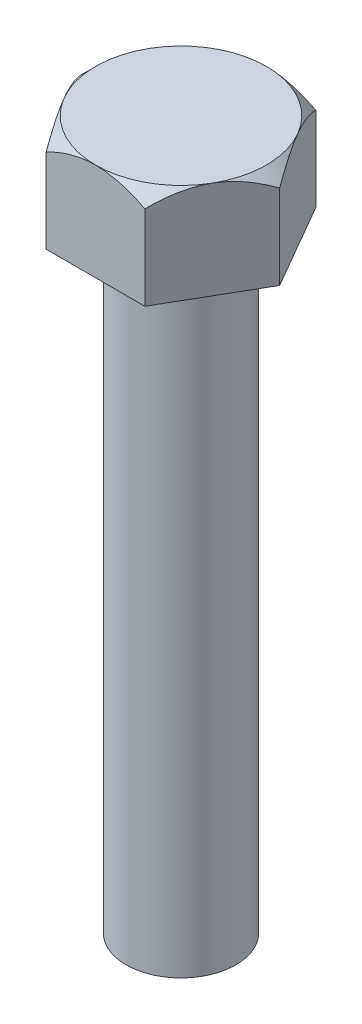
ISO-10303-21;
HEADER;
FILE_DESCRIPTION(('STEP AP214'),'2;1');
FILE_NAME('part.step','',(''),(''),'','','');
FILE_SCHEMA(('AUTOMOTIVE_DESIGN { 1 0 10303 214 1 1 1 1 }'));
ENDSEC;
DATA;
#1=APPLICATION_CONTEXT('core data for automotive mechanical design processes');
#2=APPLICATION_PROTOCOL_DEFINITION('international standard','automotive_design',2000,#1);
#3=PRODUCT_CONTEXT('',#1,'mechanical');
#4=PRODUCT('Part','Part','',(#3));
#5=PRODUCT_RELATED_PRODUCT_CATEGORY('part','',(#4));
#6=PRODUCT_DEFINITION_FORMATION('','',#4);
#7=PRODUCT_DEFINITION_CONTEXT('part definition',#1,'design');
#8=PRODUCT_DEFINITION('design','',#6,#7);
#9=PRODUCT_DEFINITION_SHAPE('','',#8);
#10=(LENGTH_UNIT() NAMED_UNIT(*) SI_UNIT(.MILLI.,.METRE.));
#11=(NAMED_UNIT(*) PLANE_ANGLE_UNIT() SI_UNIT($,.RADIAN.));
#12=(NAMED_UNIT(*) SI_UNIT($,.STERADIAN.) SOLID_ANGLE_UNIT());
#13=UNCERTAINTY_MEASURE_WITH_UNIT(LENGTH_MEASURE(1.E-05),#10,'distance_accuracy_value','');
#14=(GEOMETRIC_REPRESENTATION_CONTEXT(3) GLOBAL_UNCERTAINTY_ASSIGNED_CONTEXT((#13)) GLOBAL_UNIT_ASSIGNED_CONTEXT((#10,
#11,#12)) REPRESENTATION_CONTEXT('',''));
#15=CARTESIAN_POINT('',(0.,0.,0.));
#16=DIRECTION('',(0.,0.,1.));
#17=DIRECTION('',(1.,0.,0.));
#18=AXIS2_PLACEMENT_3D('',#15,#16,#17);
#19=CARTESIAN_POINT('',(2.02072594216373,4.,3.49999999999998));
#20=DIRECTION('',(-0.866025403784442,0.,-0.499999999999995));
#21=DIRECTION('',(-0.499999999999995,0.,0.866025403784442));
#22=AXIS2_PLACEMENT_3D('',#19,#20,#21);
#23=PLANE('',#22);
#24=CARTESIAN_POINT('',(2.02061047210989,3.45843264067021,3.50019999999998));
#25=CARTESIAN_POINT('',(2.09007076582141,3.52783218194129,3.37989124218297));
#26=CARTESIAN_POINT('',(2.16069251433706,3.59315563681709,3.25757078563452));
#27=CARTESIAN_POINT('',(2.30469791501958,3.71276106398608,3.00814611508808));
#28=CARTESIAN_POINT('',(2.37809526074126,3.76697649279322,2.88101818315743));
#29=CARTESIAN_POINT('',(2.52609746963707,3.85984844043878,2.62467083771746));
#30=CARTESIAN_POINT('',(2.60066464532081,3.89873837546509,2.4955167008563));
#31=CARTESIAN_POINT('',(2.75144053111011,3.95865621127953,2.23436520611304));
#32=CARTESIAN_POINT('',(2.8276446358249,3.97972883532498,2.10237582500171));
#33=CARTESIAN_POINT('',(2.95898000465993,3.99874200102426,1.87489629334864));
#34=CARTESIAN_POINT('',(3.01394167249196,4.00155641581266,1.77969989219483));
#35=CARTESIAN_POINT('',(3.12377560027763,3.99681342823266,1.5894619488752));
#36=CARTESIAN_POINT('',(3.17864782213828,3.98925238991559,1.49442047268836));
#37=CARTESIAN_POINT('',(3.28787240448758,3.9641902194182,1.30523794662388));
#38=CARTESIAN_POINT('',(3.34222411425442,3.9466779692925,1.21109802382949));
#39=CARTESIAN_POINT('',(3.44999406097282,3.90266921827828,1.02443500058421));
#40=CARTESIAN_POINT('',(3.50341236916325,3.87617340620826,0.931911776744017));
#41=CARTESIAN_POINT('',(3.59824414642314,3.82166014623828,0.767658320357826));
#42=CARTESIAN_POINT('',(3.63986754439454,3.79507581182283,0.695564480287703));
#43=CARTESIAN_POINT('',(3.72236709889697,3.73762274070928,0.552671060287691));
#44=CARTESIAN_POINT('',(3.76324323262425,3.70675387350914,0.48187151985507));
#45=CARTESIAN_POINT('',(3.84411947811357,3.64142377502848,0.341789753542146));
#46=CARTESIAN_POINT('',(3.88412189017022,3.60697384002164,0.272503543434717));
#47=CARTESIAN_POINT('',(3.96338588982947,3.53493401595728,0.135214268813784));
#48=CARTESIAN_POINT('',(4.00264791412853,3.49734605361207,0.0672104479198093));
#49=CARTESIAN_POINT('',(4.04156735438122,3.45843264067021,-0.000200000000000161));
#50=B_SPLINE_CURVE_WITH_KNOTS('',3,(#24,#25,#26,#27,#28,#29,#30,#31,#32,#33,#34,#35,#36,#37,#38,
#39,#40,#41,#42,#43,#44,#45,#46,#47,#48,#49),.UNSPECIFIED.,.F.,.F.,(4,2,2,2,2,2,2,2,2,2,2,2,4),
(0.,0.466195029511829,0.935106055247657,1.39657035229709,1.85687285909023,2.18628459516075,
2.5158117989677,2.84570789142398,3.17557869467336,3.43762138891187,3.69967206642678,
3.96091985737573,4.22200840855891),.UNSPECIFIED.);
#51=CARTESIAN_POINT('',(2.02072594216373,3.45854811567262,3.49999999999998));
#52=VERTEX_POINT('',#51);
#53=CARTESIAN_POINT('',(3.03108891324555,4.,1.74999999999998));
#54=VERTEX_POINT('',#53);
#55=EDGE_CURVE('E115',#52,#54,#50,.T.);
#56=ORIENTED_EDGE('',*,*,#55,.F.);
#57=DIRECTION('',(0.,-1.,0.));
#58=VECTOR('',#57,1.);
#59=CARTESIAN_POINT('',(2.02072594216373,4.,3.49999999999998));
#60=LINE('',#59,#58);
#61=CARTESIAN_POINT('',(2.02072594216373,0.,3.49999999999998));
#62=VERTEX_POINT('',#61);
#63=EDGE_CURVE('E64',#52,#62,#60,.T.);
#64=ORIENTED_EDGE('',*,*,#63,.T.);
#65=DIRECTION('',(0.499999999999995,0.,-0.866025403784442));
#66=VECTOR('',#65,1.);
#67=CARTESIAN_POINT('',(2.02072594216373,0.,3.49999999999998));
#68=LINE('',#67,#66);
#69=CARTESIAN_POINT('',(4.04145188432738,0.,0.));
#70=VERTEX_POINT('',#69);
#71=EDGE_CURVE('E253',#62,#70,#68,.T.);
#72=ORIENTED_EDGE('',*,*,#71,.T.);
#73=DIRECTION('',(0.,-1.,0.));
#74=VECTOR('',#73,1.);
#75=CARTESIAN_POINT('',(4.04145188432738,4.,0.));
#76=LINE('',#75,#74);
#77=CARTESIAN_POINT('',(4.04145188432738,3.45854811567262,0.));
#78=VERTEX_POINT('',#77);
#79=EDGE_CURVE('E137',#78,#70,#76,.T.);
#80=ORIENTED_EDGE('',*,*,#79,.F.);
#81=EDGE_CURVE('E124',#54,#78,#50,.T.);
#82=ORIENTED_EDGE('',*,*,#81,.F.);
#83=EDGE_LOOP('',(#56,#64,#72,#80,#82));
#84=FACE_BOUND('',#83,.T.);
#85=ADVANCED_FACE('F40',(#84),#23,.F.);
#86=CARTESIAN_POINT('',(4.04145188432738,4.,0.));
#87=DIRECTION('',(-0.866025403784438,0.,0.500000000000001));
#88=DIRECTION('',(0.500000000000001,0.,0.866025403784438));
#89=AXIS2_PLACEMENT_3D('',#86,#87,#88);
#90=PLANE('',#89);
#91=CARTESIAN_POINT('',(4.04156735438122,3.45843264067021,0.0002));
#92=CARTESIAN_POINT('',(3.9721070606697,3.52783218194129,-0.120108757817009));
#93=CARTESIAN_POINT('',(3.90148531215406,3.59315563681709,-0.242429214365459));
#94=CARTESIAN_POINT('',(3.75747991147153,3.71276106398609,-0.491853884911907));
#95=CARTESIAN_POINT('',(3.68408256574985,3.76697649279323,-0.618981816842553));
#96=CARTESIAN_POINT('',(3.53608035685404,3.85984844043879,-0.875329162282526));
#97=CARTESIAN_POINT('',(3.46151318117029,3.8987383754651,-1.00448329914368));
#98=CARTESIAN_POINT('',(3.31073729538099,3.95865621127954,-1.26563479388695));
#99=CARTESIAN_POINT('',(3.2345331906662,3.979728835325,-1.39762417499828));
#100=CARTESIAN_POINT('',(3.10319782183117,3.99874200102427,-1.62510370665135));
#101=CARTESIAN_POINT('',(3.04823615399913,4.00155641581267,-1.72030010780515));
#102=CARTESIAN_POINT('',(2.93840222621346,3.99681342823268,-1.91053805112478));
#103=CARTESIAN_POINT('',(2.88353000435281,3.98925238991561,-2.00557952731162));
#104=CARTESIAN_POINT('',(2.77430542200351,3.96419021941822,-2.1947620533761));
#105=CARTESIAN_POINT('',(2.71995371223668,3.94667796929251,-2.2889019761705));
#106=CARTESIAN_POINT('',(2.61218376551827,3.9026692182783,-2.47556499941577));
#107=CARTESIAN_POINT('',(2.55876545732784,3.87617340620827,-2.56808822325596));
#108=CARTESIAN_POINT('',(2.46393368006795,3.82166014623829,-2.73234167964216));
#109=CARTESIAN_POINT('',(2.42231028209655,3.79507581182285,-2.80443551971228));
#110=CARTESIAN_POINT('',(2.33981072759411,3.73762274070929,-2.9473289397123));
#111=CARTESIAN_POINT('',(2.29893459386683,3.70675387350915,-3.01812848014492));
#112=CARTESIAN_POINT('',(2.21805834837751,3.64142377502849,-3.15821024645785));
#113=CARTESIAN_POINT('',(2.17805593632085,3.60697384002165,-3.22749645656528));
#114=CARTESIAN_POINT('',(2.0987919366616,3.53493401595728,-3.36478573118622));
#115=CARTESIAN_POINT('',(2.05952991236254,3.49734605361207,-3.4327895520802));
#116=CARTESIAN_POINT('',(2.02061047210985,3.45843264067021,-3.50020000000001));
#117=B_SPLINE_CURVE_WITH_KNOTS('',3,(#91,#92,#93,#94,#95,#96,#97,#98,#99,#100,#101,#102,#103,
#104,#105,#106,#107,#108,#109,#110,#111,#112,#113,#114,#115,#116),.UNSPECIFIED.,.F.,.F.,(4,2,2,
2,2,2,2,2,2,2,2,2,4),(0.,0.466195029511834,0.935106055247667,1.3965703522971,1.85687285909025,
2.18628459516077,2.51581179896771,2.845707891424,3.17557869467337,3.43762138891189,
3.69967206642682,3.96091985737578,4.22200840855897),.UNSPECIFIED.);
#118=CARTESIAN_POINT('',(3.03108891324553,4.,-1.75));
#119=VERTEX_POINT('',#118);
#120=EDGE_CURVE('E129',#78,#119,#117,.T.);
#121=ORIENTED_EDGE('',*,*,#120,.F.);
#122=ORIENTED_EDGE('',*,*,#79,.T.);
#123=DIRECTION('',(-0.500000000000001,0.,-0.866025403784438));
#124=VECTOR('',#123,1.);
#125=CARTESIAN_POINT('',(4.04145188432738,0.,0.));
#126=LINE('',#125,#124);
#127=CARTESIAN_POINT('',(2.02072594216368,0.,-3.50000000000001));
#128=VERTEX_POINT('',#127);
#129=EDGE_CURVE('E256',#70,#128,#126,.T.);
#130=ORIENTED_EDGE('',*,*,#129,.T.);
#131=DIRECTION('',(0.,-1.,0.));
#132=VECTOR('',#131,1.);
#133=CARTESIAN_POINT('',(2.02072594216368,4.,-3.50000000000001));
#134=LINE('',#133,#132);
#135=CARTESIAN_POINT('',(2.02072594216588,3.45854811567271,-3.50000000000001));
#136=VERTEX_POINT('',#135);
#137=EDGE_CURVE('E210',#136,#128,#134,.T.);
#138=ORIENTED_EDGE('',*,*,#137,.F.);
#139=EDGE_CURVE('E140',#119,#136,#117,.T.);
#140=ORIENTED_EDGE('',*,*,#139,.F.);
#141=EDGE_LOOP('',(#121,#122,#130,#138,#140));
#142=FACE_BOUND('',#141,.T.);
#143=ADVANCED_FACE('F198',(#142),#90,.F.);
#144=CARTESIAN_POINT('',(2.02072594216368,4.,-3.50000000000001));
#145=DIRECTION('',(0.,0.,1.));
#146=DIRECTION('',(1.,0.,0.));
#147=AXIS2_PLACEMENT_3D('',#144,#145,#146);
#148=PLANE('',#147);
#149=CARTESIAN_POINT('',(7.70716664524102,-0.96465697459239,-3.50000000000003));
#150=CARTESIAN_POINT('',(7.48137878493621,-0.759135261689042,-3.50000000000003));
#151=CARTESIAN_POINT('',(7.25487498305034,-0.554389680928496,-3.50000000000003));
#152=CARTESIAN_POINT('',(6.79984084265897,-0.147044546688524,-3.50000000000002));
#153=CARTESIAN_POINT('',(6.57130998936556,0.0555544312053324,-3.50000000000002));
#154=CARTESIAN_POINT('',(6.10997227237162,0.459456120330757,-3.50000000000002));
#155=CARTESIAN_POINT('',(5.87714602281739,0.660736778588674,-3.50000000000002));
#156=CARTESIAN_POINT('',(5.52538737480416,0.95965543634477,-3.50000000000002));
#157=CARTESIAN_POINT('',(5.40772405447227,1.05878684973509,-3.50000000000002));
#158=CARTESIAN_POINT('',(5.17140128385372,1.25587149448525,-3.50000000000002));
#159=CARTESIAN_POINT('',(5.05274176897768,1.35382464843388,-3.50000000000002));
#160=CARTESIAN_POINT('',(4.72855665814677,1.61823727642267,-3.50000000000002));
#161=CARTESIAN_POINT('',(4.52190647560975,1.78332365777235,-3.50000000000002));
#162=CARTESIAN_POINT('',(4.10413126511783,2.10773727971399,-3.50000000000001));
#163=CARTESIAN_POINT('',(3.89300676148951,2.26706518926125,-3.50000000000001));
#164=CARTESIAN_POINT('',(3.57190983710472,2.49968433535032,-3.50000000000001));
#165=CARTESIAN_POINT('',(3.46421302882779,2.5761149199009,-3.50000000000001));
#166=CARTESIAN_POINT('',(3.24704746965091,2.72641028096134,-3.50000000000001));
#167=CARTESIAN_POINT('',(3.13757882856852,2.8002752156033,-3.50000000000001));
#168=CARTESIAN_POINT('',(2.91663090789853,2.94480957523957,-3.50000000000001));
#169=CARTESIAN_POINT('',(2.805152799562,3.01548078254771,-3.50000000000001));
#170=CARTESIAN_POINT('',(2.57979608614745,3.15289000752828,-3.50000000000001));
#171=CARTESIAN_POINT('',(2.46591757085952,3.21962817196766,-3.50000000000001));
#172=CARTESIAN_POINT('',(2.23926046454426,3.34599637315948,-3.50000000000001));
#173=CARTESIAN_POINT('',(2.12657447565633,3.40579029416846,-3.50000000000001));
#174=CARTESIAN_POINT('',(1.89832432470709,3.51956975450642,-3.50000000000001));
#175=CARTESIAN_POINT('',(1.78275963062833,3.57355421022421,-3.50000000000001));
#176=CARTESIAN_POINT('',(1.43160000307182,3.72442650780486,-3.50000000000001));
#177=CARTESIAN_POINT('',(1.19096103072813,3.81057245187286,-3.5));
#178=CARTESIAN_POINT('',(0.844192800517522,3.90093897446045,-3.5));
#179=CARTESIAN_POINT('',(0.742755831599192,3.92347008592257,-3.5));
#180=CARTESIAN_POINT('',(0.538372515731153,3.96026053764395,-3.5));
#181=CARTESIAN_POINT('',(0.435426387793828,3.97452106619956,-3.5));
#182=CARTESIAN_POINT('',(0.228874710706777,3.99402845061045,-3.5));
#183=CARTESIAN_POINT('',(0.125270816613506,3.99929264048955,-3.5));
#184=CARTESIAN_POINT('',(-0.0819976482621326,4.00057360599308,-3.5));
#185=CARTESIAN_POINT('',(-0.185662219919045,3.9965902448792,-3.5));
#186=CARTESIAN_POINT('',(-0.391954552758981,3.9796186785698,-3.5));
#187=CARTESIAN_POINT('',(-0.494584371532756,3.96665508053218,-3.5));
#188=CARTESIAN_POINT('',(-0.698450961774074,3.93240601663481,-3.5));
#189=CARTESIAN_POINT('',(-0.799687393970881,3.91111855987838,-3.5));
#190=CARTESIAN_POINT('',(-1.00055886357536,3.86109571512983,-3.5));
#191=CARTESIAN_POINT('',(-1.10018908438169,3.83234121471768,-3.5));
#192=CARTESIAN_POINT('',(-1.29735290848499,3.76845561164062,-3.5));
#193=CARTESIAN_POINT('',(-1.39488662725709,3.73332486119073,-3.5));
#194=CARTESIAN_POINT('',(-1.62398143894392,3.64352283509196,-3.5));
#195=CARTESIAN_POINT('',(-1.75460225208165,3.58646149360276,-3.49999999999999));
#196=CARTESIAN_POINT('',(-2.01212538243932,3.46443559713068,-3.49999999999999));
#197=CARTESIAN_POINT('',(-2.13902566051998,3.39946680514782,-3.49999999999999));
#198=CARTESIAN_POINT('',(-2.38975030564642,3.26327874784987,-3.49999999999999));
#199=CARTESIAN_POINT('',(-2.51356756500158,3.19204649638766,-3.49999999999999));
#200=CARTESIAN_POINT('',(-2.75828903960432,3.04482209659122,-3.49999999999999));
#201=CARTESIAN_POINT('',(-2.87919376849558,2.96883079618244,-3.49999999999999));
#202=CARTESIAN_POINT('',(-3.11981544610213,2.81226955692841,-3.49999999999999));
#203=CARTESIAN_POINT('',(-3.23950628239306,2.73165967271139,-3.49999999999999));
#204=CARTESIAN_POINT('',(-3.47678034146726,2.56738645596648,-3.49999999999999));
#205=CARTESIAN_POINT('',(-3.59436338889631,2.48372287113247,-3.49999999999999));
#206=CARTESIAN_POINT('',(-3.8275953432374,2.31404838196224,-3.49999999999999));
#207=CARTESIAN_POINT('',(-3.94324646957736,2.22804051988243,-3.49999999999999));
#208=CARTESIAN_POINT('',(-4.17303756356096,2.05402747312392,-3.49999999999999));
#209=CARTESIAN_POINT('',(-4.28717748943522,1.96602223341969,-3.49999999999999));
#210=CARTESIAN_POINT('',(-4.5459744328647,1.7634775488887,-3.49999999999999));
#211=CARTESIAN_POINT('',(-4.69022023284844,1.64841320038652,-3.49999999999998));
#212=CARTESIAN_POINT('',(-4.97697874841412,1.41614645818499,-3.49999999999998));
#213=CARTESIAN_POINT('',(-5.11949143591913,1.29894402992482,-3.49999999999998));
#214=CARTESIAN_POINT('',(-5.54501613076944,0.94466948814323,-3.49999999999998));
#215=CARTESIAN_POINT('',(-5.82588928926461,0.705029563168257,-3.49999999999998));
#216=CARTESIAN_POINT('',(-6.37505783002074,0.228589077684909,-3.49999999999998));
#217=CARTESIAN_POINT('',(-6.64347451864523,-0.00807251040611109,-3.49999999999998));
#218=CARTESIAN_POINT('',(-7.04391472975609,-0.365311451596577,-3.49999999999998));
#219=CARTESIAN_POINT('',(-7.17698223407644,-0.484721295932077,-3.49999999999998));
#220=CARTESIAN_POINT('',(-7.44250845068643,-0.724211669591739,-3.49999999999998));
#221=CARTESIAN_POINT('',(-7.57496717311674,-0.844292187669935,-3.49999999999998));
#222=CARTESIAN_POINT('',(-7.70716664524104,-0.964656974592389,-3.49999999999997));
#223=B_SPLINE_CURVE_WITH_KNOTS('',3,(#149,#150,#151,#152,#153,#154,#155,#156,#157,#158,#159,
#160,#161,#162,#163,#164,#165,#166,#167,#168,#169,#170,#171,#172,#173,#174,#175,#176,#177,#178,
#179,#180,#181,#182,#183,#184,#185,#186,#187,#188,#189,#190,#191,#192,#193,#194,#195,#196,#197,
#198,#199,#200,#201,#202,#203,#204,#205,#206,#207,#208,#209,#210,#211,#212,#213,#214,#215,#216,
#217,#218,#219,#220,#221,#222),.UNSPECIFIED.,.F.,.F.,(4,2,2,2,2,2,2,2,2,2,2,2,2,2,2,2,2,2,2,2,2,
2,2,2,2,2,2,2,2,2,2,2,2,2,2,2,4),(0.,0.915963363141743,1.8321664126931,2.75543658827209,
3.21699839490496,3.67859036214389,4.47201065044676,5.26533846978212,5.66149422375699,
6.05762551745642,6.45353294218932,6.84942558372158,7.23195625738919,7.61455815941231,
8.37775884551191,8.68921200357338,9.00062040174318,9.31142810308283,9.62224040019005,
9.93220437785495,10.2422425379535,10.5530822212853,10.8639047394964,11.2911653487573,
11.7186559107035,12.1470546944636,12.5753773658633,13.0082330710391,13.4411246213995,
13.8734788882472,14.3058450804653,14.8593699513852,15.412903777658,16.5204516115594,
17.5939713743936,18.1303377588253,18.6666951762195),.UNSPECIFIED.);
#224=CARTESIAN_POINT('',(0.,4.,-3.5));
#225=VERTEX_POINT('',#224);
#226=EDGE_CURVE('E192',#136,#225,#223,.T.);
#227=ORIENTED_EDGE('',*,*,#226,.F.);
#228=ORIENTED_EDGE('',*,*,#137,.T.);
#229=DIRECTION('',(-1.,0.,0.));
#230=VECTOR('',#229,1.);
#231=CARTESIAN_POINT('',(2.02072594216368,0.,-3.50000000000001));
#232=LINE('',#231,#230);
#233=CARTESIAN_POINT('',(-2.02072594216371,0.,-3.49999999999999));
#234=VERTEX_POINT('',#233);
#235=EDGE_CURVE('E232',#128,#234,#232,.T.);
#236=ORIENTED_EDGE('',*,*,#235,.T.);
#237=DIRECTION('',(0.,-1.,0.));
#238=VECTOR('',#237,1.);
#239=CARTESIAN_POINT('',(-2.02072594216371,4.,-3.49999999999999));
#240=LINE('',#239,#238);
#241=CARTESIAN_POINT('',(-2.02072594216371,3.45854811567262,-3.49999999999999));
#242=VERTEX_POINT('',#241);
#243=EDGE_CURVE('E230',#242,#234,#240,.T.);
#244=ORIENTED_EDGE('',*,*,#243,.F.);
#245=EDGE_CURVE('E185',#225,#242,#223,.T.);
#246=ORIENTED_EDGE('',*,*,#245,.F.);
#247=EDGE_LOOP('',(#227,#228,#236,#244,#246));
#248=FACE_BOUND('',#247,.T.);
#249=ADVANCED_FACE('F194',(#248),#148,.F.);
#250=CARTESIAN_POINT('',(-2.02072594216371,4.,-3.49999999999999));
#251=DIRECTION('',(0.866025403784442,0.,0.499999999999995));
#252=DIRECTION('',(0.499999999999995,0.,-0.866025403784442));
#253=AXIS2_PLACEMENT_3D('',#250,#251,#252);
#254=PLANE('',#253);
#255=CARTESIAN_POINT('',(-2.02061047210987,3.45843264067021,-3.50019999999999));
#256=CARTESIAN_POINT('',(-2.09007076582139,3.52783218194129,-3.37989124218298));
#257=CARTESIAN_POINT('',(-2.16069251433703,3.59315563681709,-3.25757078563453));
#258=CARTESIAN_POINT('',(-2.30469791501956,3.71276106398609,-3.00814611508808));
#259=CARTESIAN_POINT('',(-2.37809526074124,3.76697649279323,-2.88101818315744));
#260=CARTESIAN_POINT('',(-2.52609746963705,3.85984844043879,-2.62467083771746));
#261=CARTESIAN_POINT('',(-2.60066464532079,3.8987383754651,-2.4955167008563));
#262=CARTESIAN_POINT('',(-2.75144053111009,3.95865621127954,-2.23436520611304));
#263=CARTESIAN_POINT('',(-2.82764463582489,3.979728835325,-2.10237582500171));
#264=CARTESIAN_POINT('',(-2.95898000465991,3.99874200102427,-1.87489629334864));
#265=CARTESIAN_POINT('',(-3.01394167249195,4.00155641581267,-1.77969989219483));
#266=CARTESIAN_POINT('',(-3.12377560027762,3.99681342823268,-1.5894619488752));
#267=CARTESIAN_POINT('',(-3.17864782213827,3.98925238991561,-1.49442047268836));
#268=CARTESIAN_POINT('',(-3.28787240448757,3.96419021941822,-1.30523794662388));
#269=CARTESIAN_POINT('',(-3.3422241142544,3.94667796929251,-1.21109802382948));
#270=CARTESIAN_POINT('',(-3.44999406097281,3.9026692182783,-1.02443500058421));
#271=CARTESIAN_POINT('',(-3.50341236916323,3.87617340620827,-0.931911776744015));
#272=CARTESIAN_POINT('',(-3.59824414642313,3.82166014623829,-0.767658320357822));
#273=CARTESIAN_POINT('',(-3.63986754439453,3.79507581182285,-0.695564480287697));
#274=CARTESIAN_POINT('',(-3.72236709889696,3.73762274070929,-0.55267106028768));
#275=CARTESIAN_POINT('',(-3.76324323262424,3.70675387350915,-0.481871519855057));
#276=CARTESIAN_POINT('',(-3.84411947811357,3.64142377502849,-0.341789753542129));
#277=CARTESIAN_POINT('',(-3.88412189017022,3.60697384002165,-0.272503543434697));
#278=CARTESIAN_POINT('',(-3.96338588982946,3.53493401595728,-0.13521426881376));
#279=CARTESIAN_POINT('',(-4.00264791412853,3.49734605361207,-0.0672104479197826));
#280=CARTESIAN_POINT('',(-4.04156735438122,3.45843264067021,0.000200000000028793));
#281=B_SPLINE_CURVE_WITH_KNOTS('',3,(#255,#256,#257,#258,#259,#260,#261,#262,#263,#264,#265,
#266,#267,#268,#269,#270,#271,#272,#273,#274,#275,#276,#277,#278,#279,#280),.UNSPECIFIED.,.F.,
.F.,(4,2,2,2,2,2,2,2,2,2,2,2,4),(0.,0.466195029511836,0.93510605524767,1.39657035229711,
1.85687285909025,2.18628459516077,2.51581179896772,2.84570789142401,3.17557869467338,
3.4376213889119,3.69967206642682,3.96091985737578,4.22200840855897),.UNSPECIFIED.);
#282=CARTESIAN_POINT('',(-3.03108891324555,4.,-1.74999999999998));
#283=VERTEX_POINT('',#282);
#284=EDGE_CURVE('E193',#242,#283,#281,.T.);
#285=ORIENTED_EDGE('',*,*,#284,.F.);
#286=ORIENTED_EDGE('',*,*,#243,.T.);
#287=DIRECTION('',(-0.499999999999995,0.,0.866025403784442));
#288=VECTOR('',#287,1.);
#289=CARTESIAN_POINT('',(-2.02072594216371,0.,-3.49999999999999));
#290=LINE('',#289,#288);
#291=CARTESIAN_POINT('',(-4.04145188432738,0.,0.));
#292=VERTEX_POINT('',#291);
#293=EDGE_CURVE('E261',#234,#292,#290,.T.);
#294=ORIENTED_EDGE('',*,*,#293,.T.);
#295=DIRECTION('',(0.,-1.,0.));
#296=VECTOR('',#295,1.);
#297=CARTESIAN_POINT('',(-4.04145188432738,4.,0.));
#298=LINE('',#297,#296);
#299=CARTESIAN_POINT('',(-4.04145188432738,3.45854811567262,0.));
#300=VERTEX_POINT('',#299);
#301=EDGE_CURVE('E237',#300,#292,#298,.T.);
#302=ORIENTED_EDGE('',*,*,#301,.F.);
#303=EDGE_CURVE('E179',#283,#300,#281,.T.);
#304=ORIENTED_EDGE('',*,*,#303,.F.);
#305=EDGE_LOOP('',(#285,#286,#294,#302,#304));
#306=FACE_BOUND('',#305,.T.);
#307=ADVANCED_FACE('F197',(#306),#254,.F.);
#308=CARTESIAN_POINT('',(-4.04145188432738,4.,0.));
#309=DIRECTION('',(0.866025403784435,0.,-0.500000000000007));
#310=DIRECTION('',(-0.500000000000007,0.,-0.866025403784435));
#311=AXIS2_PLACEMENT_3D('',#308,#309,#310);
#312=PLANE('',#311);
#313=CARTESIAN_POINT('',(-4.04156735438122,3.45843264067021,-0.000199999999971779));
#314=CARTESIAN_POINT('',(-3.9721070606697,3.52783218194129,0.120108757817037));
#315=CARTESIAN_POINT('',(-3.90148531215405,3.59315563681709,0.242429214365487));
#316=CARTESIAN_POINT('',(-3.75747991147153,3.71276106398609,0.491853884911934));
#317=CARTESIAN_POINT('',(-3.68408256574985,3.76697649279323,0.618981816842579));
#318=CARTESIAN_POINT('',(-3.53608035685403,3.85984844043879,0.875329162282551));
#319=CARTESIAN_POINT('',(-3.46151318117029,3.8987383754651,1.00448329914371));
#320=CARTESIAN_POINT('',(-3.31073729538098,3.95865621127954,1.26563479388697));
#321=CARTESIAN_POINT('',(-3.23453319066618,3.979728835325,1.3976241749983));
#322=CARTESIAN_POINT('',(-3.10319782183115,3.99874200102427,1.62510370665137));
#323=CARTESIAN_POINT('',(-3.04823615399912,4.00155641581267,1.72030010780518));
#324=CARTESIAN_POINT('',(-2.93840222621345,3.99681342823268,1.9105380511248));
#325=CARTESIAN_POINT('',(-2.8835300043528,3.98925238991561,2.00557952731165));
#326=CARTESIAN_POINT('',(-2.7743054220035,3.96419021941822,2.19476205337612));
#327=CARTESIAN_POINT('',(-2.71995371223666,3.94667796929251,2.28890197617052));
#328=CARTESIAN_POINT('',(-2.61218376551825,3.9026692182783,2.47556499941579));
#329=CARTESIAN_POINT('',(-2.55876545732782,3.87617340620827,2.56808822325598));
#330=CARTESIAN_POINT('',(-2.46393368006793,3.82166014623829,2.73234167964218));
#331=CARTESIAN_POINT('',(-2.42231028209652,3.79507581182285,2.8044355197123));
#332=CARTESIAN_POINT('',(-2.33981072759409,3.73762274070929,2.94732893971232));
#333=CARTESIAN_POINT('',(-2.29893459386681,3.70675387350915,3.01812848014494));
#334=CARTESIAN_POINT('',(-2.21805834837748,3.64142377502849,3.15821024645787));
#335=CARTESIAN_POINT('',(-2.17805593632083,3.60697384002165,3.2274964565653));
#336=CARTESIAN_POINT('',(-2.09879193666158,3.53493401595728,3.36478573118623));
#337=CARTESIAN_POINT('',(-2.05952991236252,3.49734605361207,3.43278955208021));
#338=CARTESIAN_POINT('',(-2.02061047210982,3.45843264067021,3.50020000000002));
#339=B_SPLINE_CURVE_WITH_KNOTS('',3,(#313,#314,#315,#316,#317,#318,#319,#320,#321,#322,#323,
#324,#325,#326,#327,#328,#329,#330,#331,#332,#333,#334,#335,#336,#337,#338),.UNSPECIFIED.,.F.,
.F.,(4,2,2,2,2,2,2,2,2,2,2,2,4),(0.,0.466195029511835,0.935106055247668,1.3965703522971,
1.85687285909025,2.18628459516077,2.51581179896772,2.845707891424,3.17557869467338,
3.4376213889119,3.69967206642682,3.96091985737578,4.22200840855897),.UNSPECIFIED.);
#340=CARTESIAN_POINT('',(-3.03108891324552,4.,1.75000000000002));
#341=VERTEX_POINT('',#340);
#342=EDGE_CURVE('E290',#300,#341,#339,.T.);
#343=ORIENTED_EDGE('',*,*,#342,.F.);
#344=ORIENTED_EDGE('',*,*,#301,.T.);
#345=DIRECTION('',(0.500000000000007,0.,0.866025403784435));
#346=VECTOR('',#345,1.);
#347=CARTESIAN_POINT('',(-4.04145188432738,0.,0.));
#348=LINE('',#347,#346);
#349=CARTESIAN_POINT('',(-2.02072594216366,0.,3.50000000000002));
#350=VERTEX_POINT('',#349);
#351=EDGE_CURVE('E264',#292,#350,#348,.T.);
#352=ORIENTED_EDGE('',*,*,#351,.T.);
#353=DIRECTION('',(0.,-1.,0.));
#354=VECTOR('',#353,1.);
#355=CARTESIAN_POINT('',(-2.02072594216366,4.,3.50000000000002));
#356=LINE('',#355,#354);
#357=CARTESIAN_POINT('',(-2.02072594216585,3.45854811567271,3.50000000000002));
#358=VERTEX_POINT('',#357);
#359=EDGE_CURVE('E242',#358,#350,#356,.T.);
#360=ORIENTED_EDGE('',*,*,#359,.F.);
#361=EDGE_CURVE('E172',#341,#358,#339,.T.);
#362=ORIENTED_EDGE('',*,*,#361,.F.);
#363=EDGE_LOOP('',(#343,#344,#352,#360,#362));
#364=FACE_BOUND('',#363,.T.);
#365=ADVANCED_FACE('F284',(#364),#312,.F.);
#366=CARTESIAN_POINT('',(-2.02072594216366,4.,3.50000000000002));
#367=DIRECTION('',(0.,0.,-1.));
#368=DIRECTION('',(-1.,0.,0.));
#369=AXIS2_PLACEMENT_3D('',#366,#367,#368);
#370=PLANE('',#369);
#371=CARTESIAN_POINT('',(-7.70716664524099,-0.964656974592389,3.50000000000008));
#372=CARTESIAN_POINT('',(-7.48137878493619,-0.759135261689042,3.50000000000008));
#373=CARTESIAN_POINT('',(-7.25487498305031,-0.554389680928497,3.50000000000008));
#374=CARTESIAN_POINT('',(-6.79984084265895,-0.147044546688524,3.50000000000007));
#375=CARTESIAN_POINT('',(-6.57130998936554,0.0555544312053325,3.50000000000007));
#376=CARTESIAN_POINT('',(-6.10997227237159,0.459456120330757,3.50000000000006));
#377=CARTESIAN_POINT('',(-5.87714602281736,0.660736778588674,3.50000000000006));
#378=CARTESIAN_POINT('',(-5.52538737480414,0.95965543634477,3.50000000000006));
#379=CARTESIAN_POINT('',(-5.40772405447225,1.05878684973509,3.50000000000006));
#380=CARTESIAN_POINT('',(-5.17140128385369,1.25587149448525,3.50000000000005));
#381=CARTESIAN_POINT('',(-5.05274176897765,1.35382464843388,3.50000000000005));
#382=CARTESIAN_POINT('',(-4.72855665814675,1.61823727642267,3.50000000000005));
#383=CARTESIAN_POINT('',(-4.52190647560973,1.78332365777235,3.50000000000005));
#384=CARTESIAN_POINT('',(-4.10413126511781,2.10773727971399,3.50000000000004));
#385=CARTESIAN_POINT('',(-3.89300676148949,2.26706518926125,3.50000000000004));
#386=CARTESIAN_POINT('',(-3.5719098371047,2.49968433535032,3.50000000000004));
#387=CARTESIAN_POINT('',(-3.46421302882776,2.5761149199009,3.50000000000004));
#388=CARTESIAN_POINT('',(-3.24704746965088,2.72641028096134,3.50000000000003));
#389=CARTESIAN_POINT('',(-3.1375788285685,2.8002752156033,3.50000000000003));
#390=CARTESIAN_POINT('',(-2.91663090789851,2.94480957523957,3.50000000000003));
#391=CARTESIAN_POINT('',(-2.80515279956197,3.01548078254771,3.50000000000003));
#392=CARTESIAN_POINT('',(-2.57979608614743,3.15289000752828,3.50000000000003));
#393=CARTESIAN_POINT('',(-2.4659175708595,3.21962817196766,3.50000000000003));
#394=CARTESIAN_POINT('',(-2.23926046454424,3.34599637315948,3.50000000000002));
#395=CARTESIAN_POINT('',(-2.12657447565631,3.40579029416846,3.50000000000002));
#396=CARTESIAN_POINT('',(-1.89832432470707,3.51956975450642,3.50000000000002));
#397=CARTESIAN_POINT('',(-1.7827596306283,3.57355421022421,3.50000000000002));
#398=CARTESIAN_POINT('',(-1.4316000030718,3.72442650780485,3.50000000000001));
#399=CARTESIAN_POINT('',(-1.19096103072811,3.81057245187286,3.50000000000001));
#400=CARTESIAN_POINT('',(-0.844192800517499,3.90093897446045,3.50000000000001));
#401=CARTESIAN_POINT('',(-0.742755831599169,3.92347008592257,3.50000000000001));
#402=CARTESIAN_POINT('',(-0.53837251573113,3.96026053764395,3.50000000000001));
#403=CARTESIAN_POINT('',(-0.435426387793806,3.97452106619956,3.5));
#404=CARTESIAN_POINT('',(-0.228874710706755,3.99402845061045,3.5));
#405=CARTESIAN_POINT('',(-0.125270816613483,3.99929264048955,3.5));
#406=CARTESIAN_POINT('',(0.0819976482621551,4.00057360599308,3.5));
#407=CARTESIAN_POINT('',(0.185662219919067,3.9965902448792,3.5));
#408=CARTESIAN_POINT('',(0.391954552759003,3.9796186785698,3.5));
#409=CARTESIAN_POINT('',(0.494584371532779,3.96665508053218,3.5));
#410=CARTESIAN_POINT('',(0.698450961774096,3.93240601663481,3.49999999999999));
#411=CARTESIAN_POINT('',(0.799687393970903,3.91111855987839,3.49999999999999));
#412=CARTESIAN_POINT('',(1.00055886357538,3.86109571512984,3.49999999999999));
#413=CARTESIAN_POINT('',(1.10018908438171,3.83234121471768,3.49999999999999));
#414=CARTESIAN_POINT('',(1.29735290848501,3.76845561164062,3.49999999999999));
#415=CARTESIAN_POINT('',(1.39488662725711,3.73332486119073,3.49999999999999));
#416=CARTESIAN_POINT('',(1.62398143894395,3.64352283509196,3.49999999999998));
#417=CARTESIAN_POINT('',(1.75460225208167,3.58646149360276,3.49999999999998));
#418=CARTESIAN_POINT('',(2.01212538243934,3.46443559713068,3.49999999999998));
#419=CARTESIAN_POINT('',(2.13902566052,3.39946680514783,3.49999999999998));
#420=CARTESIAN_POINT('',(2.38975030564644,3.26327874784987,3.49999999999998));
#421=CARTESIAN_POINT('',(2.51356756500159,3.19204649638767,3.49999999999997));
#422=CARTESIAN_POINT('',(2.75828903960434,3.04482209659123,3.49999999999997));
#423=CARTESIAN_POINT('',(2.8791937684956,2.96883079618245,3.49999999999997));
#424=CARTESIAN_POINT('',(3.11981544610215,2.81226955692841,3.49999999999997));
#425=CARTESIAN_POINT('',(3.23950628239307,2.7316596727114,3.49999999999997));
#426=CARTESIAN_POINT('',(3.47678034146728,2.56738645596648,3.49999999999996));
#427=CARTESIAN_POINT('',(3.59436338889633,2.48372287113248,3.49999999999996));
#428=CARTESIAN_POINT('',(3.82759534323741,2.31404838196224,3.49999999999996));
#429=CARTESIAN_POINT('',(3.94324646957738,2.22804051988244,3.49999999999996));
#430=CARTESIAN_POINT('',(4.17303756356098,2.05402747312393,3.49999999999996));
#431=CARTESIAN_POINT('',(4.28717748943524,1.9660222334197,3.49999999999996));
#432=CARTESIAN_POINT('',(4.54597443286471,1.7634775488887,3.49999999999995));
#433=CARTESIAN_POINT('',(4.69022023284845,1.64841320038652,3.49999999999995));
#434=CARTESIAN_POINT('',(4.97697874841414,1.416146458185,3.49999999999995));
#435=CARTESIAN_POINT('',(5.11949143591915,1.29894402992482,3.49999999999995));
#436=CARTESIAN_POINT('',(5.54501613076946,0.944669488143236,3.49999999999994));
#437=CARTESIAN_POINT('',(5.82588928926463,0.705029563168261,3.49999999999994));
#438=CARTESIAN_POINT('',(6.37505783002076,0.228589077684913,3.49999999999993));
#439=CARTESIAN_POINT('',(6.64347451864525,-0.00807251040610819,3.49999999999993));
#440=CARTESIAN_POINT('',(7.04391472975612,-0.365311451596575,3.49999999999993));
#441=CARTESIAN_POINT('',(7.17698223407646,-0.484721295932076,3.49999999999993));
#442=CARTESIAN_POINT('',(7.44250845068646,-0.724211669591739,3.49999999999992));
#443=CARTESIAN_POINT('',(7.57496717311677,-0.844292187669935,3.49999999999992));
#444=CARTESIAN_POINT('',(7.70716664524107,-0.96465697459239,3.49999999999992));
#445=B_SPLINE_CURVE_WITH_KNOTS('',3,(#371,#372,#373,#374,#375,#376,#377,#378,#379,#380,#381,
#382,#383,#384,#385,#386,#387,#388,#389,#390,#391,#392,#393,#394,#395,#396,#397,#398,#399,#400,
#401,#402,#403,#404,#405,#406,#407,#408,#409,#410,#411,#412,#413,#414,#415,#416,#417,#418,#419,
#420,#421,#422,#423,#424,#425,#426,#427,#428,#429,#430,#431,#432,#433,#434,#435,#436,#437,#438,
#439,#440,#441,#442,#443,#444),.UNSPECIFIED.,.F.,.F.,(4,2,2,2,2,2,2,2,2,2,2,2,2,2,2,2,2,2,2,2,2,
2,2,2,2,2,2,2,2,2,2,2,2,2,2,2,4),(0.,0.915963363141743,1.8321664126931,2.75543658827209,
3.21699839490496,3.67859036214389,4.47201065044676,5.26533846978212,5.66149422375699,
6.05762551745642,6.45353294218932,6.84942558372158,7.23195625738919,7.61455815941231,
8.37775884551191,8.68921200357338,9.00062040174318,9.31142810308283,9.62224040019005,
9.93220437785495,10.2422425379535,10.5530822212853,10.8639047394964,11.2911653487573,
11.7186559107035,12.1470546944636,12.5753773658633,13.0082330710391,13.4411246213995,
13.8734788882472,14.3058450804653,14.8593699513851,15.412903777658,16.5204516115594,
17.5939713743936,18.1303377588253,18.6666951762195),.UNSPECIFIED.);
#446=CARTESIAN_POINT('',(0.,4.,3.5));
#447=VERTEX_POINT('',#446);
#448=EDGE_CURVE('E279',#358,#447,#445,.T.);
#449=ORIENTED_EDGE('',*,*,#448,.F.);
#450=ORIENTED_EDGE('',*,*,#359,.T.);
#451=DIRECTION('',(1.,0.,0.));
#452=VECTOR('',#451,1.);
#453=CARTESIAN_POINT('',(-2.02072594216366,0.,3.50000000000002));
#454=LINE('',#453,#452);
#455=EDGE_CURVE('E268',#350,#62,#454,.T.);
#456=ORIENTED_EDGE('',*,*,#455,.T.);
#457=ORIENTED_EDGE('',*,*,#63,.F.);
#458=EDGE_CURVE('E120',#447,#52,#445,.T.);
#459=ORIENTED_EDGE('',*,*,#458,.F.);
#460=EDGE_LOOP('',(#449,#450,#456,#457,#459));
#461=FACE_BOUND('',#460,.T.);
#462=ADVANCED_FACE('F276',(#461),#370,.F.);
#463=CARTESIAN_POINT('',(0.,0.,0.));
#464=DIRECTION('',(0.,1.,0.));
#465=DIRECTION('',(0.,0.,1.));
#466=AXIS2_PLACEMENT_3D('',#463,#464,#465);
#467=PLANE('',#466);
#468=CARTESIAN_POINT('',(0.,0.,0.));
#469=DIRECTION('',(0.,-1.,0.));
#470=DIRECTION('',(0.,0.,-1.));
#471=AXIS2_PLACEMENT_3D('',#468,#469,#470);
#472=CIRCLE('',#471,2.25);
#473=CARTESIAN_POINT('',(0.,0.,-2.25));
#474=VERTEX_POINT('',#473);
#475=EDGE_CURVE('E246',#474,#474,#472,.T.);
#476=ORIENTED_EDGE('',*,*,#475,.F.);
#477=EDGE_LOOP('',(#476));
#478=FACE_BOUND('',#477,.T.);
#479=ORIENTED_EDGE('',*,*,#71,.F.);
#480=ORIENTED_EDGE('',*,*,#455,.F.);
#481=ORIENTED_EDGE('',*,*,#351,.F.);
#482=ORIENTED_EDGE('',*,*,#293,.F.);
#483=ORIENTED_EDGE('',*,*,#235,.F.);
#484=ORIENTED_EDGE('',*,*,#129,.F.);
#485=EDGE_LOOP('',(#479,#480,#481,#482,#483,#484));
#486=FACE_BOUND('',#485,.T.);
#487=ADVANCED_FACE('F287',(#478,#486),#467,.F.);
#488=CARTESIAN_POINT('',(0.,-25.,0.));
#489=DIRECTION('',(0.,1.,0.));
#490=DIRECTION('',(0.,0.,1.));
#491=AXIS2_PLACEMENT_3D('',#488,#489,#490);
#492=CYLINDRICAL_SURFACE('',#491,2.25);
#493=CARTESIAN_POINT('',(0.,-25.,0.));
#494=DIRECTION('',(0.,-1.,0.));
#495=DIRECTION('',(0.,0.,-1.));
#496=AXIS2_PLACEMENT_3D('',#493,#494,#495);
#497=CIRCLE('',#496,2.25);
#498=CARTESIAN_POINT('',(0.,-25.,-2.25));
#499=VERTEX_POINT('',#498);
#500=EDGE_CURVE('E123',#499,#499,#497,.T.);
#501=ORIENTED_EDGE('',*,*,#500,.F.);
#502=EDGE_LOOP('',(#501));
#503=FACE_BOUND('',#502,.T.);
#504=ORIENTED_EDGE('',*,*,#475,.T.);
#505=EDGE_LOOP('',(#504));
#506=FACE_BOUND('',#505,.T.);
#507=ADVANCED_FACE('F307',(#503,#506),#492,.T.);
#508=CARTESIAN_POINT('',(0.,-25.,0.));
#509=DIRECTION('',(0.,-1.,0.));
#510=DIRECTION('',(0.,0.,-1.));
#511=AXIS2_PLACEMENT_3D('',#508,#509,#510);
#512=PLANE('',#511);
#513=ORIENTED_EDGE('',*,*,#500,.T.);
#514=EDGE_LOOP('',(#513));
#515=FACE_BOUND('',#514,.T.);
#516=ADVANCED_FACE('F158',(#515),#512,.T.);
#517=CARTESIAN_POINT('',(0.,4.,0.));
#518=DIRECTION('',(0.,-1.,0.));
#519=DIRECTION('',(0.,0.,1.));
#520=AXIS2_PLACEMENT_3D('',#517,#518,#519);
#521=CONICAL_SURFACE('',#520,3.5,0.78539816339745);
#522=ORIENTED_EDGE('',*,*,#361,.T.);
#523=ORIENTED_EDGE('',*,*,#448,.T.);
#524=CARTESIAN_POINT('',(0.,4.,0.));
#525=DIRECTION('',(0.,1.,0.));
#526=DIRECTION('',(0.,0.,1.));
#527=AXIS2_PLACEMENT_3D('',#524,#525,#526);
#528=CIRCLE('',#527,3.5);
#529=EDGE_CURVE('E44',#341,#447,#528,.T.);
#530=ORIENTED_EDGE('',*,*,#529,.F.);
#531=EDGE_LOOP('',(#522,#523,#530));
#532=FACE_BOUND('',#531,.T.);
#533=ADVANCED_FACE('F157',(#532),#521,.T.);
#534=ORIENTED_EDGE('',*,*,#303,.T.);
#535=ORIENTED_EDGE('',*,*,#342,.T.);
#536=EDGE_CURVE('E226',#283,#341,#528,.T.);
#537=ORIENTED_EDGE('',*,*,#536,.F.);
#538=EDGE_LOOP('',(#534,#535,#537));
#539=FACE_BOUND('',#538,.T.);
#540=ADVANCED_FACE('F298',(#539),#521,.T.);
#541=ORIENTED_EDGE('',*,*,#245,.T.);
#542=ORIENTED_EDGE('',*,*,#284,.T.);
#543=EDGE_CURVE('E220',#225,#283,#528,.T.);
#544=ORIENTED_EDGE('',*,*,#543,.F.);
#545=EDGE_LOOP('',(#541,#542,#544));
#546=FACE_BOUND('',#545,.T.);
#547=ADVANCED_FACE('F221',(#546),#521,.T.);
#548=ORIENTED_EDGE('',*,*,#139,.T.);
#549=ORIENTED_EDGE('',*,*,#226,.T.);
#550=EDGE_CURVE('E50',#119,#225,#528,.T.);
#551=ORIENTED_EDGE('',*,*,#550,.F.);
#552=EDGE_LOOP('',(#548,#549,#551));
#553=FACE_BOUND('',#552,.T.);
#554=ADVANCED_FACE('F216',(#553),#521,.T.);
#555=ORIENTED_EDGE('',*,*,#81,.T.);
#556=ORIENTED_EDGE('',*,*,#120,.T.);
#557=EDGE_CURVE('E12',#54,#119,#528,.T.);
#558=ORIENTED_EDGE('',*,*,#557,.F.);
#559=EDGE_LOOP('',(#555,#556,#558));
#560=FACE_BOUND('',#559,.T.);
#561=ADVANCED_FACE('F127',(#560),#521,.T.);
#562=ORIENTED_EDGE('',*,*,#55,.T.);
#563=CARTESIAN_POINT('',(0.,4.,0.));
#564=DIRECTION('',(0.,1.,0.));
#565=DIRECTION('',(0.,0.,1.));
#566=AXIS2_PLACEMENT_3D('',#563,#564,#565);
#567=CIRCLE('',#566,3.5);
#568=EDGE_CURVE('E118',#447,#54,#567,.T.);
#569=ORIENTED_EDGE('',*,*,#568,.F.);
#570=ORIENTED_EDGE('',*,*,#458,.T.);
#571=EDGE_LOOP('',(#562,#569,#570));
#572=FACE_BOUND('',#571,.T.);
#573=ADVANCED_FACE('F117',(#572),#521,.T.);
#574=CARTESIAN_POINT('',(0.,4.,0.));
#575=DIRECTION('',(0.,1.,0.));
#576=DIRECTION('',(0.,0.,1.));
#577=AXIS2_PLACEMENT_3D('',#574,#575,#576);
#578=PLANE('',#577);
#579=ORIENTED_EDGE('',*,*,#529,.T.);
#580=ORIENTED_EDGE('',*,*,#568,.T.);
#581=ORIENTED_EDGE('',*,*,#557,.T.);
#582=ORIENTED_EDGE('',*,*,#550,.T.);
#583=ORIENTED_EDGE('',*,*,#543,.T.);
#584=ORIENTED_EDGE('',*,*,#536,.T.);
#585=EDGE_LOOP('',(#579,#580,#581,#582,#583,#584));
#586=FACE_BOUND('',#585,.T.);
#587=ADVANCED_FACE('F133',(#586),#578,.T.);
#588=CLOSED_SHELL('',(#85,#143,#249,#307,#365,#462,#487,#507,#516,#533,#540,#547,#554,#561,#573,#587));
#589=MANIFOLD_SOLID_BREP('B2',#588);
#590=ADVANCED_BREP_SHAPE_REPRESENTATION('',(#18,#589),#14);
#591=SHAPE_DEFINITION_REPRESENTATION(#9,#590);
ENDSEC;
END-ISO-10303-21;
